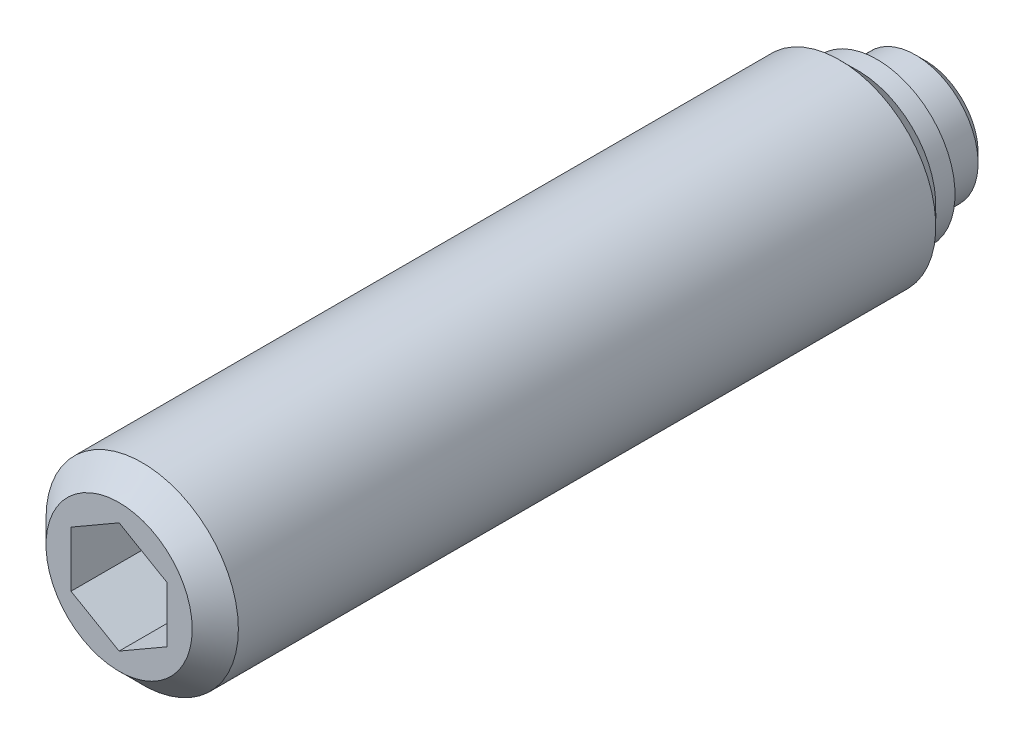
ISO-10303-21;
HEADER;
FILE_DESCRIPTION(('STEP AP214'),'2;1');
FILE_NAME('part.step','',(''),(''),'','','');
FILE_SCHEMA(('AUTOMOTIVE_DESIGN { 1 0 10303 214 1 1 1 1 }'));
ENDSEC;
DATA;
#1=APPLICATION_CONTEXT('core data for automotive mechanical design processes');
#2=APPLICATION_PROTOCOL_DEFINITION('international standard','automotive_design',2000,#1);
#3=PRODUCT_CONTEXT('',#1,'mechanical');
#4=PRODUCT('Part','Part','',(#3));
#5=PRODUCT_RELATED_PRODUCT_CATEGORY('part','',(#4));
#6=PRODUCT_DEFINITION_FORMATION('','',#4);
#7=PRODUCT_DEFINITION_CONTEXT('part definition',#1,'design');
#8=PRODUCT_DEFINITION('design','',#6,#7);
#9=PRODUCT_DEFINITION_SHAPE('','',#8);
#10=(LENGTH_UNIT() NAMED_UNIT(*) SI_UNIT(.MILLI.,.METRE.));
#11=(NAMED_UNIT(*) PLANE_ANGLE_UNIT() SI_UNIT($,.RADIAN.));
#12=(NAMED_UNIT(*) SI_UNIT($,.STERADIAN.) SOLID_ANGLE_UNIT());
#13=UNCERTAINTY_MEASURE_WITH_UNIT(LENGTH_MEASURE(1.E-05),#10,'distance_accuracy_value','');
#14=(GEOMETRIC_REPRESENTATION_CONTEXT(3) GLOBAL_UNCERTAINTY_ASSIGNED_CONTEXT((#13)) GLOBAL_UNIT_ASSIGNED_CONTEXT((#10,
#11,#12)) REPRESENTATION_CONTEXT('',''));
#15=CARTESIAN_POINT('',(0.,0.,0.));
#16=DIRECTION('',(0.,0.,1.));
#17=DIRECTION('',(1.,0.,0.));
#18=AXIS2_PLACEMENT_3D('',#15,#16,#17);
#19=CARTESIAN_POINT('',(0.,0.,0.));
#20=DIRECTION('',(0.,0.,-1.));
#21=DIRECTION('',(-1.,0.,0.));
#22=AXIS2_PLACEMENT_3D('',#19,#20,#21);
#23=CYLINDRICAL_SURFACE('',#22,3.25);
#24=CARTESIAN_POINT('',(0.,0.,0.5));
#25=DIRECTION('',(0.,0.,-1.));
#26=DIRECTION('',(-1.,0.,0.));
#27=AXIS2_PLACEMENT_3D('',#24,#25,#26);
#28=CIRCLE('',#27,3.25);
#29=CARTESIAN_POINT('',(-3.25,0.,0.5));
#30=VERTEX_POINT('',#29);
#31=EDGE_CURVE('E133',#30,#30,#28,.T.);
#32=ORIENTED_EDGE('',*,*,#31,.F.);
#33=EDGE_LOOP('',(#32));
#34=FACE_BOUND('',#33,.T.);
#35=CARTESIAN_POINT('',(0.,0.,2.5));
#36=DIRECTION('',(0.,0.,-1.));
#37=DIRECTION('',(-1.,0.,0.));
#38=AXIS2_PLACEMENT_3D('',#35,#36,#37);
#39=CIRCLE('',#38,3.25);
#40=CARTESIAN_POINT('',(-3.25,0.,2.5));
#41=VERTEX_POINT('',#40);
#42=EDGE_CURVE('E127',#41,#41,#39,.T.);
#43=ORIENTED_EDGE('',*,*,#42,.T.);
#44=EDGE_LOOP('',(#43));
#45=FACE_BOUND('',#44,.T.);
#46=ADVANCED_FACE('F14',(#34,#45),#23,.T.);
#47=CARTESIAN_POINT('',(0.,0.,0.5));
#48=DIRECTION('',(0.,0.,1.));
#49=DIRECTION('',(1.,0.,0.));
#50=AXIS2_PLACEMENT_3D('',#47,#48,#49);
#51=CONICAL_SURFACE('',#50,3.25,0.785398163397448);
#52=CARTESIAN_POINT('',(0.,0.,0.));
#53=DIRECTION('',(0.,0.,-1.));
#54=DIRECTION('',(-1.,0.,0.));
#55=AXIS2_PLACEMENT_3D('',#52,#53,#54);
#56=CIRCLE('',#55,2.75);
#57=CARTESIAN_POINT('',(-2.75,0.,0.));
#58=VERTEX_POINT('',#57);
#59=EDGE_CURVE('E130',#58,#58,#56,.T.);
#60=ORIENTED_EDGE('',*,*,#59,.F.);
#61=EDGE_LOOP('',(#60));
#62=FACE_BOUND('',#61,.T.);
#63=ORIENTED_EDGE('',*,*,#31,.T.);
#64=EDGE_LOOP('',(#63));
#65=FACE_BOUND('',#64,.T.);
#66=ADVANCED_FACE('F159',(#62,#65),#51,.T.);
#67=CARTESIAN_POINT('',(0.,2.75,0.));
#68=DIRECTION('',(0.,0.,1.));
#69=DIRECTION('',(1.,0.,0.));
#70=AXIS2_PLACEMENT_3D('',#67,#68,#69);
#71=PLANE('',#70);
#72=ORIENTED_EDGE('',*,*,#59,.T.);
#73=EDGE_LOOP('',(#72));
#74=FACE_BOUND('',#73,.T.);
#75=ADVANCED_FACE('F165',(#74),#71,.F.);
#76=CARTESIAN_POINT('',(0.,0.,2.5));
#77=DIRECTION('',(0.,0.,-1.));
#78=DIRECTION('',(-1.,0.,0.));
#79=AXIS2_PLACEMENT_3D('',#76,#77,#78);
#80=CYLINDRICAL_SURFACE('',#79,5.);
#81=CARTESIAN_POINT('',(0.,0.,4.45));
#82=DIRECTION('',(0.,0.,-1.));
#83=DIRECTION('',(-1.,0.,0.));
#84=AXIS2_PLACEMENT_3D('',#81,#82,#83);
#85=CIRCLE('',#84,5.);
#86=CARTESIAN_POINT('',(-5.,0.,4.45));
#87=VERTEX_POINT('',#86);
#88=EDGE_CURVE('E9',#87,#87,#85,.T.);
#89=ORIENTED_EDGE('',*,*,#88,.F.);
#90=EDGE_LOOP('',(#89));
#91=FACE_BOUND('',#90,.T.);
#92=CARTESIAN_POINT('',(0.,0.,40.7));
#93=DIRECTION('',(0.,0.,1.));
#94=DIRECTION('',(1.,0.,0.));
#95=AXIS2_PLACEMENT_3D('',#92,#93,#94);
#96=CIRCLE('',#95,5.);
#97=CARTESIAN_POINT('',(5.,0.,40.7));
#98=VERTEX_POINT('',#97);
#99=EDGE_CURVE('E124',#98,#98,#96,.T.);
#100=ORIENTED_EDGE('',*,*,#99,.F.);
#101=EDGE_LOOP('',(#100));
#102=FACE_BOUND('',#101,.T.);
#103=ADVANCED_FACE('F16',(#91,#102),#80,.T.);
#104=CARTESIAN_POINT('',(0.,4.05,2.5));
#105=DIRECTION('',(0.,0.,1.));
#106=DIRECTION('',(1.,0.,0.));
#107=AXIS2_PLACEMENT_3D('',#104,#105,#106);
#108=PLANE('',#107);
#109=CARTESIAN_POINT('',(0.,0.,2.5));
#110=DIRECTION('',(0.,0.,-1.));
#111=DIRECTION('',(-1.,0.,0.));
#112=AXIS2_PLACEMENT_3D('',#109,#110,#111);
#113=CIRCLE('',#112,4.05);
#114=CARTESIAN_POINT('',(-4.05,0.,2.5));
#115=VERTEX_POINT('',#114);
#116=EDGE_CURVE('E136',#115,#115,#113,.T.);
#117=ORIENTED_EDGE('',*,*,#116,.T.);
#118=EDGE_LOOP('',(#117));
#119=FACE_BOUND('',#118,.T.);
#120=ORIENTED_EDGE('',*,*,#42,.F.);
#121=EDGE_LOOP('',(#120));
#122=FACE_BOUND('',#121,.T.);
#123=ADVANCED_FACE('F156',(#119,#122),#108,.F.);
#124=CARTESIAN_POINT('',(0.,0.,2.5));
#125=DIRECTION('',(0.,0.,-1.));
#126=DIRECTION('',(-1.,0.,0.));
#127=AXIS2_PLACEMENT_3D('',#124,#125,#126);
#128=CYLINDRICAL_SURFACE('',#127,4.05);
#129=CARTESIAN_POINT('',(0.,0.,3.5));
#130=DIRECTION('',(0.,0.,-1.));
#131=DIRECTION('',(-1.,0.,0.));
#132=AXIS2_PLACEMENT_3D('',#129,#130,#131);
#133=CIRCLE('',#132,4.05);
#134=CARTESIAN_POINT('',(-4.05,0.,3.5));
#135=VERTEX_POINT('',#134);
#136=EDGE_CURVE('E22',#135,#135,#133,.T.);
#137=ORIENTED_EDGE('',*,*,#136,.T.);
#138=EDGE_LOOP('',(#137));
#139=FACE_BOUND('',#138,.T.);
#140=ORIENTED_EDGE('',*,*,#116,.F.);
#141=EDGE_LOOP('',(#140));
#142=FACE_BOUND('',#141,.T.);
#143=ADVANCED_FACE('F141',(#139,#142),#128,.T.);
#144=CARTESIAN_POINT('',(0.,0.,4.45));
#145=DIRECTION('',(0.,0.,1.));
#146=DIRECTION('',(1.,0.,0.));
#147=AXIS2_PLACEMENT_3D('',#144,#145,#146);
#148=CONICAL_SURFACE('',#147,5.,0.785398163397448);
#149=ORIENTED_EDGE('',*,*,#88,.T.);
#150=EDGE_LOOP('',(#149));
#151=FACE_BOUND('',#150,.T.);
#152=ORIENTED_EDGE('',*,*,#136,.F.);
#153=EDGE_LOOP('',(#152));
#154=FACE_BOUND('',#153,.T.);
#155=ADVANCED_FACE('F144',(#151,#154),#148,.T.);
#156=CARTESIAN_POINT('',(0.,-3.8,41.9));
#157=DIRECTION('',(0.,0.,1.));
#158=DIRECTION('',(1.,0.,0.));
#159=AXIS2_PLACEMENT_3D('',#156,#157,#158);
#160=PLANE('',#159);
#161=DIRECTION('',(0.866025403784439,-0.5,0.));
#162=VECTOR('',#161,1.);
#163=CARTESIAN_POINT('',(-2.5,-1.44337567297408,41.9));
#164=LINE('',#163,#162);
#165=CARTESIAN_POINT('',(-2.5,-1.44337567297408,41.9));
#166=VERTEX_POINT('',#165);
#167=CARTESIAN_POINT('',(0.,-2.88675134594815,41.9));
#168=VERTEX_POINT('',#167);
#169=EDGE_CURVE('E29',#166,#168,#164,.T.);
#170=ORIENTED_EDGE('',*,*,#169,.F.);
#171=DIRECTION('',(0.,-1.,0.));
#172=VECTOR('',#171,1.);
#173=CARTESIAN_POINT('',(-2.5,1.44337567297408,41.9));
#174=LINE('',#173,#172);
#175=CARTESIAN_POINT('',(-2.5,1.44337567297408,41.9));
#176=VERTEX_POINT('',#175);
#177=EDGE_CURVE('E112',#176,#166,#174,.T.);
#178=ORIENTED_EDGE('',*,*,#177,.F.);
#179=DIRECTION('',(-0.866025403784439,-0.5,0.));
#180=VECTOR('',#179,1.);
#181=CARTESIAN_POINT('',(0.,2.88675134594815,41.9));
#182=LINE('',#181,#180);
#183=CARTESIAN_POINT('',(0.,2.88675134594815,41.9));
#184=VERTEX_POINT('',#183);
#185=EDGE_CURVE('E110',#184,#176,#182,.T.);
#186=ORIENTED_EDGE('',*,*,#185,.F.);
#187=DIRECTION('',(-0.866025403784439,0.5,0.));
#188=VECTOR('',#187,1.);
#189=CARTESIAN_POINT('',(2.5,1.44337567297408,41.9));
#190=LINE('',#189,#188);
#191=CARTESIAN_POINT('',(2.5,1.44337567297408,41.9));
#192=VERTEX_POINT('',#191);
#193=EDGE_CURVE('E77',#192,#184,#190,.T.);
#194=ORIENTED_EDGE('',*,*,#193,.F.);
#195=DIRECTION('',(0.,1.,0.));
#196=VECTOR('',#195,1.);
#197=CARTESIAN_POINT('',(2.5,-1.44337567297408,41.9));
#198=LINE('',#197,#196);
#199=CARTESIAN_POINT('',(2.5,-1.44337567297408,41.9));
#200=VERTEX_POINT('',#199);
#201=EDGE_CURVE('E106',#200,#192,#198,.T.);
#202=ORIENTED_EDGE('',*,*,#201,.F.);
#203=DIRECTION('',(0.866025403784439,0.5,0.));
#204=VECTOR('',#203,1.);
#205=CARTESIAN_POINT('',(0.,-2.88675134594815,41.9));
#206=LINE('',#205,#204);
#207=EDGE_CURVE('E103',#168,#200,#206,.T.);
#208=ORIENTED_EDGE('',*,*,#207,.F.);
#209=EDGE_LOOP('',(#170,#178,#186,#194,#202,#208));
#210=FACE_BOUND('',#209,.T.);
#211=CARTESIAN_POINT('',(0.,0.,41.9));
#212=DIRECTION('',(0.,0.,1.));
#213=DIRECTION('',(1.,0.,0.));
#214=AXIS2_PLACEMENT_3D('',#211,#212,#213);
#215=CIRCLE('',#214,3.8);
#216=CARTESIAN_POINT('',(3.8,0.,41.9));
#217=VERTEX_POINT('',#216);
#218=EDGE_CURVE('E116',#217,#217,#215,.T.);
#219=ORIENTED_EDGE('',*,*,#218,.T.);
#220=EDGE_LOOP('',(#219));
#221=FACE_BOUND('',#220,.T.);
#222=ADVANCED_FACE('F146',(#210,#221),#160,.T.);
#223=CARTESIAN_POINT('',(0.,0.,41.9));
#224=DIRECTION('',(0.,0.,-1.));
#225=DIRECTION('',(-1.,0.,0.));
#226=AXIS2_PLACEMENT_3D('',#223,#224,#225);
#227=CONICAL_SURFACE('',#226,3.8,0.785398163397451);
#228=ORIENTED_EDGE('',*,*,#99,.T.);
#229=EDGE_LOOP('',(#228));
#230=FACE_BOUND('',#229,.T.);
#231=ORIENTED_EDGE('',*,*,#218,.F.);
#232=EDGE_LOOP('',(#231));
#233=FACE_BOUND('',#232,.T.);
#234=ADVANCED_FACE('F153',(#230,#233),#227,.T.);
#235=CARTESIAN_POINT('',(-2.5,-1.44337567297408,35.9));
#236=DIRECTION('',(-0.5,-0.866025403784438,0.));
#237=DIRECTION('',(0.866025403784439,-0.5,0.));
#238=AXIS2_PLACEMENT_3D('',#235,#236,#237);
#239=PLANE('',#238);
#240=ORIENTED_EDGE('',*,*,#169,.T.);
#241=DIRECTION('',(0.,0.,1.));
#242=VECTOR('',#241,1.);
#243=CARTESIAN_POINT('',(0.,-2.88675134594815,35.9));
#244=LINE('',#243,#242);
#245=CARTESIAN_POINT('',(0.,-2.88675134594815,35.9));
#246=VERTEX_POINT('',#245);
#247=EDGE_CURVE('E59',#246,#168,#244,.T.);
#248=ORIENTED_EDGE('',*,*,#247,.F.);
#249=DIRECTION('',(0.866025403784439,-0.5,0.));
#250=VECTOR('',#249,1.);
#251=CARTESIAN_POINT('',(-2.5,-1.44337567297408,35.9));
#252=LINE('',#251,#250);
#253=CARTESIAN_POINT('',(-2.5,-1.44337567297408,35.9));
#254=VERTEX_POINT('',#253);
#255=EDGE_CURVE('E114',#254,#246,#252,.T.);
#256=ORIENTED_EDGE('',*,*,#255,.F.);
#257=DIRECTION('',(0.,0.,1.));
#258=VECTOR('',#257,1.);
#259=CARTESIAN_POINT('',(-2.5,-1.44337567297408,35.9));
#260=LINE('',#259,#258);
#261=EDGE_CURVE('E37',#254,#166,#260,.T.);
#262=ORIENTED_EDGE('',*,*,#261,.T.);
#263=EDGE_LOOP('',(#240,#248,#256,#262));
#264=FACE_BOUND('',#263,.T.);
#265=ADVANCED_FACE('F191',(#264),#239,.F.);
#266=CARTESIAN_POINT('',(-2.5,1.44337567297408,35.9));
#267=DIRECTION('',(-1.,0.,0.));
#268=DIRECTION('',(0.,0.,1.));
#269=AXIS2_PLACEMENT_3D('',#266,#267,#268);
#270=PLANE('',#269);
#271=ORIENTED_EDGE('',*,*,#177,.T.);
#272=ORIENTED_EDGE('',*,*,#261,.F.);
#273=DIRECTION('',(0.,-1.,0.));
#274=VECTOR('',#273,1.);
#275=CARTESIAN_POINT('',(-2.5,1.44337567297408,35.9));
#276=LINE('',#275,#274);
#277=CARTESIAN_POINT('',(-2.5,1.44337567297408,35.9));
#278=VERTEX_POINT('',#277);
#279=EDGE_CURVE('E89',#278,#254,#276,.T.);
#280=ORIENTED_EDGE('',*,*,#279,.F.);
#281=DIRECTION('',(0.,0.,1.));
#282=VECTOR('',#281,1.);
#283=CARTESIAN_POINT('',(-2.5,1.44337567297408,35.9));
#284=LINE('',#283,#282);
#285=EDGE_CURVE('E81',#278,#176,#284,.T.);
#286=ORIENTED_EDGE('',*,*,#285,.T.);
#287=EDGE_LOOP('',(#271,#272,#280,#286));
#288=FACE_BOUND('',#287,.T.);
#289=ADVANCED_FACE('F198',(#288),#270,.F.);
#290=CARTESIAN_POINT('',(0.,2.88675134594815,35.9));
#291=DIRECTION('',(-0.5,0.866025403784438,0.));
#292=DIRECTION('',(-0.866025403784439,-0.5,0.));
#293=AXIS2_PLACEMENT_3D('',#290,#291,#292);
#294=PLANE('',#293);
#295=ORIENTED_EDGE('',*,*,#185,.T.);
#296=ORIENTED_EDGE('',*,*,#285,.F.);
#297=DIRECTION('',(-0.866025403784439,-0.5,0.));
#298=VECTOR('',#297,1.);
#299=CARTESIAN_POINT('',(0.,2.88675134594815,35.9));
#300=LINE('',#299,#298);
#301=CARTESIAN_POINT('',(0.,2.88675134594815,35.9));
#302=VERTEX_POINT('',#301);
#303=EDGE_CURVE('E85',#302,#278,#300,.T.);
#304=ORIENTED_EDGE('',*,*,#303,.F.);
#305=DIRECTION('',(0.,0.,1.));
#306=VECTOR('',#305,1.);
#307=CARTESIAN_POINT('',(0.,2.88675134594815,35.9));
#308=LINE('',#307,#306);
#309=EDGE_CURVE('E70',#302,#184,#308,.T.);
#310=ORIENTED_EDGE('',*,*,#309,.T.);
#311=EDGE_LOOP('',(#295,#296,#304,#310));
#312=FACE_BOUND('',#311,.T.);
#313=ADVANCED_FACE('F86',(#312),#294,.F.);
#314=CARTESIAN_POINT('',(2.5,1.44337567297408,35.9));
#315=DIRECTION('',(0.5,0.866025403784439,0.));
#316=DIRECTION('',(-0.866025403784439,0.5,0.));
#317=AXIS2_PLACEMENT_3D('',#314,#315,#316);
#318=PLANE('',#317);
#319=ORIENTED_EDGE('',*,*,#193,.T.);
#320=ORIENTED_EDGE('',*,*,#309,.F.);
#321=DIRECTION('',(-0.866025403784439,0.5,0.));
#322=VECTOR('',#321,1.);
#323=CARTESIAN_POINT('',(2.5,1.44337567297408,35.9));
#324=LINE('',#323,#322);
#325=CARTESIAN_POINT('',(2.5,1.44337567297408,35.9));
#326=VERTEX_POINT('',#325);
#327=EDGE_CURVE('E74',#326,#302,#324,.T.);
#328=ORIENTED_EDGE('',*,*,#327,.F.);
#329=DIRECTION('',(0.,0.,1.));
#330=VECTOR('',#329,1.);
#331=CARTESIAN_POINT('',(2.5,1.44337567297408,35.9));
#332=LINE('',#331,#330);
#333=EDGE_CURVE('E82',#326,#192,#332,.T.);
#334=ORIENTED_EDGE('',*,*,#333,.T.);
#335=EDGE_LOOP('',(#319,#320,#328,#334));
#336=FACE_BOUND('',#335,.T.);
#337=ADVANCED_FACE('F72',(#336),#318,.F.);
#338=CARTESIAN_POINT('',(2.5,-1.44337567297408,35.9));
#339=DIRECTION('',(1.,0.,0.));
#340=DIRECTION('',(0.,1.,0.));
#341=AXIS2_PLACEMENT_3D('',#338,#339,#340);
#342=PLANE('',#341);
#343=ORIENTED_EDGE('',*,*,#201,.T.);
#344=ORIENTED_EDGE('',*,*,#333,.F.);
#345=DIRECTION('',(0.,1.,0.));
#346=VECTOR('',#345,1.);
#347=CARTESIAN_POINT('',(2.5,-1.44337567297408,35.9));
#348=LINE('',#347,#346);
#349=CARTESIAN_POINT('',(2.5,-1.44337567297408,35.9));
#350=VERTEX_POINT('',#349);
#351=EDGE_CURVE('E95',#350,#326,#348,.T.);
#352=ORIENTED_EDGE('',*,*,#351,.F.);
#353=DIRECTION('',(0.,0.,1.));
#354=VECTOR('',#353,1.);
#355=CARTESIAN_POINT('',(2.5,-1.44337567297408,35.9));
#356=LINE('',#355,#354);
#357=EDGE_CURVE('E119',#350,#200,#356,.T.);
#358=ORIENTED_EDGE('',*,*,#357,.T.);
#359=EDGE_LOOP('',(#343,#344,#352,#358));
#360=FACE_BOUND('',#359,.T.);
#361=ADVANCED_FACE('F204',(#360),#342,.F.);
#362=CARTESIAN_POINT('',(0.,-2.88675134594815,35.9));
#363=DIRECTION('',(0.5,-0.866025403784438,0.));
#364=DIRECTION('',(0.866025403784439,0.5,0.));
#365=AXIS2_PLACEMENT_3D('',#362,#363,#364);
#366=PLANE('',#365);
#367=ORIENTED_EDGE('',*,*,#207,.T.);
#368=ORIENTED_EDGE('',*,*,#357,.F.);
#369=DIRECTION('',(0.866025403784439,0.5,0.));
#370=VECTOR('',#369,1.);
#371=CARTESIAN_POINT('',(0.,-2.88675134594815,35.9));
#372=LINE('',#371,#370);
#373=EDGE_CURVE('E97',#246,#350,#372,.T.);
#374=ORIENTED_EDGE('',*,*,#373,.F.);
#375=ORIENTED_EDGE('',*,*,#247,.T.);
#376=EDGE_LOOP('',(#367,#368,#374,#375));
#377=FACE_BOUND('',#376,.T.);
#378=ADVANCED_FACE('F201',(#377),#366,.F.);
#379=CARTESIAN_POINT('',(0.,0.,35.9));
#380=DIRECTION('',(0.,0.,1.));
#381=DIRECTION('',(1.,0.,0.));
#382=AXIS2_PLACEMENT_3D('',#379,#380,#381);
#383=PLANE('',#382);
#384=ORIENTED_EDGE('',*,*,#255,.T.);
#385=ORIENTED_EDGE('',*,*,#373,.T.);
#386=ORIENTED_EDGE('',*,*,#351,.T.);
#387=ORIENTED_EDGE('',*,*,#327,.T.);
#388=ORIENTED_EDGE('',*,*,#303,.T.);
#389=ORIENTED_EDGE('',*,*,#279,.T.);
#390=EDGE_LOOP('',(#384,#385,#386,#387,#388,#389));
#391=FACE_BOUND('',#390,.T.);
#392=ADVANCED_FACE('F92',(#391),#383,.T.);
#393=CLOSED_SHELL('',(#46,#66,#75,#103,#123,#143,#155,#222,#234,#265,#289,#313,#337,#361,#378,#392));
#394=MANIFOLD_SOLID_BREP('B1',#393);
#395=ADVANCED_BREP_SHAPE_REPRESENTATION('',(#18,#394),#14);
#396=SHAPE_DEFINITION_REPRESENTATION(#9,#395);
ENDSEC;
END-ISO-10303-21;
